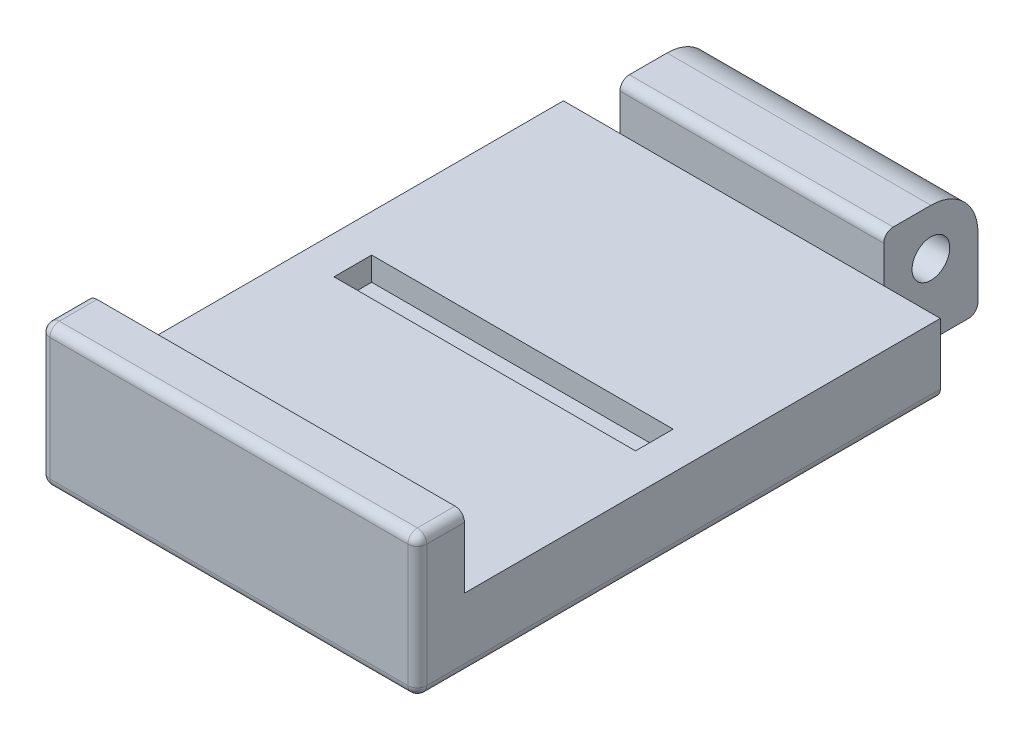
ISO-10303-21;
HEADER;
FILE_DESCRIPTION(('STEP AP214'),'2;1');
FILE_NAME('part.step','',(''),(''),'','','');
FILE_SCHEMA(('AUTOMOTIVE_DESIGN { 1 0 10303 214 1 1 1 1 }'));
ENDSEC;
DATA;
#1=APPLICATION_CONTEXT('core data for automotive mechanical design processes');
#2=APPLICATION_PROTOCOL_DEFINITION('international standard','automotive_design',2000,#1);
#3=PRODUCT_CONTEXT('',#1,'mechanical');
#4=PRODUCT('Part','Part','',(#3));
#5=PRODUCT_RELATED_PRODUCT_CATEGORY('part','',(#4));
#6=PRODUCT_DEFINITION_FORMATION('','',#4);
#7=PRODUCT_DEFINITION_CONTEXT('part definition',#1,'design');
#8=PRODUCT_DEFINITION('design','',#6,#7);
#9=PRODUCT_DEFINITION_SHAPE('','',#8);
#10=(LENGTH_UNIT() NAMED_UNIT(*) SI_UNIT(.MILLI.,.METRE.));
#11=(NAMED_UNIT(*) PLANE_ANGLE_UNIT() SI_UNIT($,.RADIAN.));
#12=(NAMED_UNIT(*) SI_UNIT($,.STERADIAN.) SOLID_ANGLE_UNIT());
#13=UNCERTAINTY_MEASURE_WITH_UNIT(LENGTH_MEASURE(1.E-05),#10,'distance_accuracy_value','');
#14=(GEOMETRIC_REPRESENTATION_CONTEXT(3) GLOBAL_UNCERTAINTY_ASSIGNED_CONTEXT((#13)) GLOBAL_UNIT_ASSIGNED_CONTEXT((#10,
#11,#12)) REPRESENTATION_CONTEXT('',''));
#15=CARTESIAN_POINT('',(0.,0.,0.));
#16=DIRECTION('',(0.,0.,1.));
#17=DIRECTION('',(1.,0.,0.));
#18=AXIS2_PLACEMENT_3D('',#15,#16,#17);
#19=CARTESIAN_POINT('',(0.,0.,0.));
#20=DIRECTION('',(0.,0.,-1.));
#21=DIRECTION('',(-1.,0.,0.));
#22=AXIS2_PLACEMENT_3D('',#19,#20,#21);
#23=PLANE('',#22);
#24=DIRECTION('',(0.,-1.,0.));
#25=VECTOR('',#24,1.);
#26=CARTESIAN_POINT('',(-14.,-7.5,0.));
#27=LINE('',#26,#25);
#28=CARTESIAN_POINT('',(-14.,-0.100000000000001,0.));
#29=VERTEX_POINT('',#28);
#30=CARTESIAN_POINT('',(-14.,-6.5,0.));
#31=VERTEX_POINT('',#30);
#32=EDGE_CURVE('E241',#29,#31,#27,.T.);
#33=ORIENTED_EDGE('',*,*,#32,.F.);
#34=DIRECTION('',(-1.,0.,0.));
#35=VECTOR('',#34,1.);
#36=CARTESIAN_POINT('',(0.,-0.100000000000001,0.));
#37=LINE('',#36,#35);
#38=CARTESIAN_POINT('',(14.,-0.100000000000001,0.));
#39=VERTEX_POINT('',#38);
#40=EDGE_CURVE('E12',#29,#39,#37,.F.);
#41=ORIENTED_EDGE('',*,*,#40,.T.);
#42=DIRECTION('',(0.,-1.,0.));
#43=VECTOR('',#42,1.);
#44=CARTESIAN_POINT('',(14.,0.,0.));
#45=LINE('',#44,#43);
#46=CARTESIAN_POINT('',(14.,-6.5,0.));
#47=VERTEX_POINT('',#46);
#48=EDGE_CURVE('E271',#39,#47,#45,.T.);
#49=ORIENTED_EDGE('',*,*,#48,.T.);
#50=DIRECTION('',(1.,0.,0.));
#51=VECTOR('',#50,1.);
#52=CARTESIAN_POINT('',(-20.,-6.5,0.));
#53=LINE('',#52,#51);
#54=EDGE_CURVE('E339',#47,#31,#53,.F.);
#55=ORIENTED_EDGE('',*,*,#54,.T.);
#56=EDGE_LOOP('',(#33,#41,#49,#55));
#57=FACE_BOUND('',#56,.T.);
#58=ADVANCED_FACE('F36',(#57),#23,.T.);
#59=CARTESIAN_POINT('',(-20.,5.,10.));
#60=DIRECTION('',(0.,0.,-1.));
#61=DIRECTION('',(-1.,0.,0.));
#62=AXIS2_PLACEMENT_3D('',#59,#60,#61);
#63=PLANE('',#62);
#64=DIRECTION('',(0.,1.,0.));
#65=VECTOR('',#64,1.);
#66=CARTESIAN_POINT('',(14.,-7.5,10.));
#67=LINE('',#66,#65);
#68=CARTESIAN_POINT('',(14.,0.,10.));
#69=VERTEX_POINT('',#68);
#70=CARTESIAN_POINT('',(14.,3.9,10.));
#71=VERTEX_POINT('',#70);
#72=EDGE_CURVE('E262',#69,#71,#67,.T.);
#73=ORIENTED_EDGE('',*,*,#72,.T.);
#74=DIRECTION('',(1.,0.,0.));
#75=VECTOR('',#74,1.);
#76=CARTESIAN_POINT('',(-14.,3.9,10.));
#77=LINE('',#76,#75);
#78=CARTESIAN_POINT('',(-14.,3.9,10.));
#79=VERTEX_POINT('',#78);
#80=EDGE_CURVE('E393',#71,#79,#77,.F.);
#81=ORIENTED_EDGE('',*,*,#80,.T.);
#82=DIRECTION('',(0.,-1.,0.));
#83=VECTOR('',#82,1.);
#84=CARTESIAN_POINT('',(-14.,-7.5,10.));
#85=LINE('',#84,#83);
#86=CARTESIAN_POINT('',(-14.,0.,10.));
#87=VERTEX_POINT('',#86);
#88=EDGE_CURVE('E245',#79,#87,#85,.T.);
#89=ORIENTED_EDGE('',*,*,#88,.T.);
#90=DIRECTION('',(1.,0.,0.));
#91=VECTOR('',#90,1.);
#92=CARTESIAN_POINT('',(-20.,0.,10.));
#93=LINE('',#92,#91);
#94=EDGE_CURVE('E291',#87,#69,#93,.T.);
#95=ORIENTED_EDGE('',*,*,#94,.T.);
#96=EDGE_LOOP('',(#73,#81,#89,#95));
#97=FACE_BOUND('',#96,.T.);
#98=ADVANCED_FACE('F414',(#97),#63,.F.);
#99=CARTESIAN_POINT('',(14.,-7.5,-0.999999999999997));
#100=DIRECTION('',(1.,0.,0.));
#101=DIRECTION('',(0.,0.,-1.));
#102=AXIS2_PLACEMENT_3D('',#99,#100,#101);
#103=PLANE('',#102);
#104=CARTESIAN_POINT('',(14.,0.,5.));
#105=DIRECTION('',(1.,0.,0.));
#106=DIRECTION('',(0.,0.,-1.));
#107=AXIS2_PLACEMENT_3D('',#104,#105,#106);
#108=CIRCLE('',#107,2.);
#109=CARTESIAN_POINT('',(14.,0.,3.));
#110=VERTEX_POINT('',#109);
#111=EDGE_CURVE('E238',#110,#110,#108,.T.);
#112=ORIENTED_EDGE('',*,*,#111,.F.);
#113=EDGE_LOOP('',(#112));
#114=FACE_BOUND('',#113,.T.);
#115=DIRECTION('',(0.,0.,1.));
#116=VECTOR('',#115,1.);
#117=CARTESIAN_POINT('',(14.,4.9,-0.999999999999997));
#118=LINE('',#117,#116);
#119=CARTESIAN_POINT('',(14.,4.9,5.));
#120=VERTEX_POINT('',#119);
#121=CARTESIAN_POINT('',(14.,4.9,9.));
#122=VERTEX_POINT('',#121);
#123=EDGE_CURVE('E231',#120,#122,#118,.T.);
#124=ORIENTED_EDGE('',*,*,#123,.T.);
#125=CARTESIAN_POINT('',(14.,3.9,9.));
#126=DIRECTION('',(1.,0.,0.));
#127=DIRECTION('',(0.,0.,-1.));
#128=AXIS2_PLACEMENT_3D('',#125,#126,#127);
#129=CIRCLE('',#128,1.);
#130=EDGE_CURVE('E391',#122,#71,#129,.T.);
#131=ORIENTED_EDGE('',*,*,#130,.T.);
#132=ORIENTED_EDGE('',*,*,#72,.F.);
#133=CARTESIAN_POINT('',(14.,-7.5,10.));
#134=VERTEX_POINT('',#133);
#135=EDGE_CURVE('E263',#134,#69,#67,.T.);
#136=ORIENTED_EDGE('',*,*,#135,.F.);
#137=DIRECTION('',(0.,0.,1.));
#138=VECTOR('',#137,1.);
#139=CARTESIAN_POINT('',(14.,-7.5,-0.999999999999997));
#140=LINE('',#139,#138);
#141=CARTESIAN_POINT('',(14.,-7.5,1.));
#142=VERTEX_POINT('',#141);
#143=EDGE_CURVE('E266',#142,#134,#140,.T.);
#144=ORIENTED_EDGE('',*,*,#143,.F.);
#145=CARTESIAN_POINT('',(14.,-6.5,1.));
#146=DIRECTION('',(1.,0.,0.));
#147=DIRECTION('',(0.,0.,-1.));
#148=AXIS2_PLACEMENT_3D('',#145,#146,#147);
#149=CIRCLE('',#148,1.);
#150=EDGE_CURVE('E273',#47,#142,#149,.F.);
#151=ORIENTED_EDGE('',*,*,#150,.F.);
#152=ORIENTED_EDGE('',*,*,#48,.F.);
#153=CARTESIAN_POINT('',(14.,-0.100000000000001,5.));
#154=DIRECTION('',(1.,0.,0.));
#155=DIRECTION('',(0.,0.,-1.));
#156=AXIS2_PLACEMENT_3D('',#153,#154,#155);
#157=CIRCLE('',#156,5.);
#158=EDGE_CURVE('E389',#39,#120,#157,.T.);
#159=ORIENTED_EDGE('',*,*,#158,.T.);
#160=EDGE_LOOP('',(#124,#131,#132,#136,#144,#151,#152,#159));
#161=FACE_BOUND('',#160,.T.);
#162=ADVANCED_FACE('F410',(#114,#161),#103,.T.);
#163=CARTESIAN_POINT('',(-14.,-7.5,10.));
#164=DIRECTION('',(1.,0.,0.));
#165=DIRECTION('',(0.,1.,0.));
#166=AXIS2_PLACEMENT_3D('',#163,#164,#165);
#167=PLANE('',#166);
#168=CARTESIAN_POINT('',(-14.,0.,5.));
#169=DIRECTION('',(1.,0.,0.));
#170=DIRECTION('',(0.,1.,0.));
#171=AXIS2_PLACEMENT_3D('',#168,#169,#170);
#172=CIRCLE('',#171,2.);
#173=CARTESIAN_POINT('',(-14.,2.,5.));
#174=VERTEX_POINT('',#173);
#175=EDGE_CURVE('E237',#174,#174,#172,.T.);
#176=ORIENTED_EDGE('',*,*,#175,.T.);
#177=EDGE_LOOP('',(#176));
#178=FACE_BOUND('',#177,.T.);
#179=ORIENTED_EDGE('',*,*,#88,.F.);
#180=CARTESIAN_POINT('',(-14.,3.9,9.));
#181=DIRECTION('',(1.,0.,0.));
#182=DIRECTION('',(0.,1.,0.));
#183=AXIS2_PLACEMENT_3D('',#180,#181,#182);
#184=CIRCLE('',#183,1.);
#185=CARTESIAN_POINT('',(-14.,4.9,9.));
#186=VERTEX_POINT('',#185);
#187=EDGE_CURVE('E44',#79,#186,#184,.F.);
#188=ORIENTED_EDGE('',*,*,#187,.T.);
#189=DIRECTION('',(0.,0.,1.));
#190=VECTOR('',#189,1.);
#191=CARTESIAN_POINT('',(-14.,4.9,10.));
#192=LINE('',#191,#190);
#193=CARTESIAN_POINT('',(-14.,4.9,5.));
#194=VERTEX_POINT('',#193);
#195=EDGE_CURVE('E378',#194,#186,#192,.T.);
#196=ORIENTED_EDGE('',*,*,#195,.F.);
#197=CARTESIAN_POINT('',(-14.,-0.100000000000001,5.));
#198=DIRECTION('',(1.,0.,0.));
#199=DIRECTION('',(0.,1.,0.));
#200=AXIS2_PLACEMENT_3D('',#197,#198,#199);
#201=CIRCLE('',#200,5.);
#202=EDGE_CURVE('E59',#194,#29,#201,.F.);
#203=ORIENTED_EDGE('',*,*,#202,.T.);
#204=ORIENTED_EDGE('',*,*,#32,.T.);
#205=CARTESIAN_POINT('',(-14.,-6.5,1.));
#206=DIRECTION('',(1.,0.,0.));
#207=DIRECTION('',(0.,1.,0.));
#208=AXIS2_PLACEMENT_3D('',#205,#206,#207);
#209=CIRCLE('',#208,1.);
#210=CARTESIAN_POINT('',(-14.,-7.5,1.));
#211=VERTEX_POINT('',#210);
#212=EDGE_CURVE('E256',#31,#211,#209,.F.);
#213=ORIENTED_EDGE('',*,*,#212,.T.);
#214=DIRECTION('',(0.,0.,-1.));
#215=VECTOR('',#214,1.);
#216=CARTESIAN_POINT('',(-14.,-7.5,10.));
#217=LINE('',#216,#215);
#218=CARTESIAN_POINT('',(-14.,-7.5,10.));
#219=VERTEX_POINT('',#218);
#220=EDGE_CURVE('E249',#219,#211,#217,.T.);
#221=ORIENTED_EDGE('',*,*,#220,.F.);
#222=EDGE_CURVE('E244',#87,#219,#85,.T.);
#223=ORIENTED_EDGE('',*,*,#222,.F.);
#224=EDGE_LOOP('',(#179,#188,#196,#203,#204,#213,#221,#223));
#225=FACE_BOUND('',#224,.T.);
#226=ADVANCED_FACE('F397',(#178,#225),#167,.F.);
#227=CARTESIAN_POINT('',(-20.,-7.5,65.5));
#228=DIRECTION('',(1.,0.,0.));
#229=DIRECTION('',(0.,0.,-1.));
#230=AXIS2_PLACEMENT_3D('',#227,#228,#229);
#231=PLANE('',#230);
#232=DIRECTION('',(0.,1.,0.));
#233=VECTOR('',#232,1.);
#234=CARTESIAN_POINT('',(-20.,-7.5,10.));
#235=LINE('',#234,#233);
#236=CARTESIAN_POINT('',(-20.,-6.5,10.));
#237=VERTEX_POINT('',#236);
#238=CARTESIAN_POINT('',(-20.,0.,10.));
#239=VERTEX_POINT('',#238);
#240=EDGE_CURVE('E242',#237,#239,#235,.T.);
#241=ORIENTED_EDGE('',*,*,#240,.F.);
#242=DIRECTION('',(0.,0.,-1.));
#243=VECTOR('',#242,1.);
#244=CARTESIAN_POINT('',(-20.,-6.5,65.5));
#245=LINE('',#244,#243);
#246=CARTESIAN_POINT('',(-20.,-6.5,64.5));
#247=VERTEX_POINT('',#246);
#248=EDGE_CURVE('E332',#237,#247,#245,.F.);
#249=ORIENTED_EDGE('',*,*,#248,.T.);
#250=DIRECTION('',(0.,-1.,0.));
#251=VECTOR('',#250,1.);
#252=CARTESIAN_POINT('',(-20.,-7.5,64.5));
#253=LINE('',#252,#251);
#254=CARTESIAN_POINT('',(-20.,6.5,64.5));
#255=VERTEX_POINT('',#254);
#256=EDGE_CURVE('E334',#247,#255,#253,.F.);
#257=ORIENTED_EDGE('',*,*,#256,.T.);
#258=DIRECTION('',(0.,0.,-1.));
#259=VECTOR('',#258,1.);
#260=CARTESIAN_POINT('',(-20.,6.5,65.5));
#261=LINE('',#260,#259);
#262=CARTESIAN_POINT('',(-20.,6.5,60.5));
#263=VERTEX_POINT('',#262);
#264=EDGE_CURVE('E336',#255,#263,#261,.T.);
#265=ORIENTED_EDGE('',*,*,#264,.T.);
#266=DIRECTION('',(0.,-1.,0.));
#267=VECTOR('',#266,1.);
#268=CARTESIAN_POINT('',(-20.,7.49999999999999,60.5));
#269=LINE('',#268,#267);
#270=CARTESIAN_POINT('',(-20.,0.,60.5));
#271=VERTEX_POINT('',#270);
#272=EDGE_CURVE('E277',#263,#271,#269,.T.);
#273=ORIENTED_EDGE('',*,*,#272,.T.);
#274=DIRECTION('',(0.,0.,-1.));
#275=VECTOR('',#274,1.);
#276=CARTESIAN_POINT('',(-20.,0.,60.5));
#277=LINE('',#276,#275);
#278=EDGE_CURVE('E279',#271,#239,#277,.T.);
#279=ORIENTED_EDGE('',*,*,#278,.T.);
#280=EDGE_LOOP('',(#241,#249,#257,#265,#273,#279));
#281=FACE_BOUND('',#280,.T.);
#282=ADVANCED_FACE('F449',(#281),#231,.F.);
#283=CARTESIAN_POINT('',(-19.,-6.5,65.5));
#284=DIRECTION('',(0.,0.,-1.));
#285=DIRECTION('',(-1.,0.,0.));
#286=AXIS2_PLACEMENT_3D('',#283,#284,#285);
#287=CYLINDRICAL_SURFACE('',#286,1.);
#288=ORIENTED_EDGE('',*,*,#248,.F.);
#289=CARTESIAN_POINT('',(-19.,-6.5,10.));
#290=DIRECTION('',(0.,0.,-1.));
#291=DIRECTION('',(-1.,0.,0.));
#292=AXIS2_PLACEMENT_3D('',#289,#290,#291);
#293=CIRCLE('',#292,1.);
#294=CARTESIAN_POINT('',(-19.,-7.5,10.));
#295=VERTEX_POINT('',#294);
#296=EDGE_CURVE('E253',#237,#295,#293,.F.);
#297=ORIENTED_EDGE('',*,*,#296,.T.);
#298=DIRECTION('',(0.,0.,-1.));
#299=VECTOR('',#298,1.);
#300=CARTESIAN_POINT('',(-19.,-7.5,65.5));
#301=LINE('',#300,#299);
#302=CARTESIAN_POINT('',(-19.,-7.5,64.5));
#303=VERTEX_POINT('',#302);
#304=EDGE_CURVE('E316',#303,#295,#301,.T.);
#305=ORIENTED_EDGE('',*,*,#304,.F.);
#306=CARTESIAN_POINT('',(-19.,-6.5,64.5));
#307=DIRECTION('',(0.,0.,1.));
#308=DIRECTION('',(1.,0.,0.));
#309=AXIS2_PLACEMENT_3D('',#306,#307,#308);
#310=CIRCLE('',#309,1.);
#311=EDGE_CURVE('E302',#247,#303,#310,.T.);
#312=ORIENTED_EDGE('',*,*,#311,.F.);
#313=EDGE_LOOP('',(#288,#297,#305,#312));
#314=FACE_BOUND('',#313,.T.);
#315=ADVANCED_FACE('F445',(#314),#287,.T.);
#316=CARTESIAN_POINT('',(-20.,-7.5,65.5));
#317=DIRECTION('',(0.,1.,0.));
#318=DIRECTION('',(0.,0.,1.));
#319=AXIS2_PLACEMENT_3D('',#316,#317,#318);
#320=PLANE('',#319);
#321=DIRECTION('',(-1.,0.,0.));
#322=VECTOR('',#321,1.);
#323=CARTESIAN_POINT('',(-20.,-7.5,10.));
#324=LINE('',#323,#322);
#325=EDGE_CURVE('E247',#219,#295,#324,.T.);
#326=ORIENTED_EDGE('',*,*,#325,.F.);
#327=ORIENTED_EDGE('',*,*,#220,.T.);
#328=DIRECTION('',(1.,0.,0.));
#329=VECTOR('',#328,1.);
#330=CARTESIAN_POINT('',(20.,-7.5,1.));
#331=LINE('',#330,#329);
#332=EDGE_CURVE('E314',#211,#142,#331,.T.);
#333=ORIENTED_EDGE('',*,*,#332,.T.);
#334=ORIENTED_EDGE('',*,*,#143,.T.);
#335=DIRECTION('',(-1.,0.,0.));
#336=VECTOR('',#335,1.);
#337=CARTESIAN_POINT('',(20.,-7.5,10.));
#338=LINE('',#337,#336);
#339=CARTESIAN_POINT('',(19.,-7.5,10.));
#340=VERTEX_POINT('',#339);
#341=EDGE_CURVE('E260',#340,#134,#338,.T.);
#342=ORIENTED_EDGE('',*,*,#341,.F.);
#343=DIRECTION('',(0.,0.,-1.));
#344=VECTOR('',#343,1.);
#345=CARTESIAN_POINT('',(19.,-7.5,65.5));
#346=LINE('',#345,#344);
#347=CARTESIAN_POINT('',(19.,-7.5,64.5));
#348=VERTEX_POINT('',#347);
#349=EDGE_CURVE('E321',#340,#348,#346,.F.);
#350=ORIENTED_EDGE('',*,*,#349,.T.);
#351=DIRECTION('',(1.,0.,0.));
#352=VECTOR('',#351,1.);
#353=CARTESIAN_POINT('',(-20.,-7.5,64.5));
#354=LINE('',#353,#352);
#355=EDGE_CURVE('E319',#348,#303,#354,.F.);
#356=ORIENTED_EDGE('',*,*,#355,.T.);
#357=ORIENTED_EDGE('',*,*,#304,.T.);
#358=EDGE_LOOP('',(#326,#327,#333,#334,#342,#350,#356,#357));
#359=FACE_BOUND('',#358,.T.);
#360=ADVANCED_FACE('F426',(#359),#320,.F.);
#361=CARTESIAN_POINT('',(-20.,-6.5,1.));
#362=DIRECTION('',(-1.,0.,0.));
#363=DIRECTION('',(0.,0.,1.));
#364=AXIS2_PLACEMENT_3D('',#361,#362,#363);
#365=CYLINDRICAL_SURFACE('',#364,1.);
#366=ORIENTED_EDGE('',*,*,#212,.F.);
#367=ORIENTED_EDGE('',*,*,#54,.F.);
#368=ORIENTED_EDGE('',*,*,#150,.T.);
#369=ORIENTED_EDGE('',*,*,#332,.F.);
#370=EDGE_LOOP('',(#366,#367,#368,#369));
#371=FACE_BOUND('',#370,.T.);
#372=ADVANCED_FACE('F432',(#371),#365,.T.);
#373=CARTESIAN_POINT('',(20.,-7.5,65.5));
#374=DIRECTION('',(-1.,0.,0.));
#375=DIRECTION('',(0.,0.,1.));
#376=AXIS2_PLACEMENT_3D('',#373,#374,#375);
#377=PLANE('',#376);
#378=DIRECTION('',(0.,0.,-1.));
#379=VECTOR('',#378,1.);
#380=CARTESIAN_POINT('',(20.,-6.5,65.5));
#381=LINE('',#380,#379);
#382=CARTESIAN_POINT('',(20.,-6.5,64.5));
#383=VERTEX_POINT('',#382);
#384=CARTESIAN_POINT('',(20.,-6.5,10.));
#385=VERTEX_POINT('',#384);
#386=EDGE_CURVE('E307',#383,#385,#381,.T.);
#387=ORIENTED_EDGE('',*,*,#386,.T.);
#388=DIRECTION('',(0.,-1.,0.));
#389=VECTOR('',#388,1.);
#390=CARTESIAN_POINT('',(20.,-7.5,10.));
#391=LINE('',#390,#389);
#392=CARTESIAN_POINT('',(20.,0.,10.));
#393=VERTEX_POINT('',#392);
#394=EDGE_CURVE('E258',#393,#385,#391,.T.);
#395=ORIENTED_EDGE('',*,*,#394,.F.);
#396=DIRECTION('',(0.,0.,-1.));
#397=VECTOR('',#396,1.);
#398=CARTESIAN_POINT('',(20.,0.,55.501553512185));
#399=LINE('',#398,#397);
#400=CARTESIAN_POINT('',(20.,0.,60.5));
#401=VERTEX_POINT('',#400);
#402=EDGE_CURVE('E280',#401,#393,#399,.T.);
#403=ORIENTED_EDGE('',*,*,#402,.F.);
#404=DIRECTION('',(0.,-1.,0.));
#405=VECTOR('',#404,1.);
#406=CARTESIAN_POINT('',(20.,7.49999999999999,60.5));
#407=LINE('',#406,#405);
#408=CARTESIAN_POINT('',(20.,6.5,60.5));
#409=VERTEX_POINT('',#408);
#410=EDGE_CURVE('E276',#409,#401,#407,.T.);
#411=ORIENTED_EDGE('',*,*,#410,.F.);
#412=DIRECTION('',(0.,0.,-1.));
#413=VECTOR('',#412,1.);
#414=CARTESIAN_POINT('',(20.,6.5,65.5));
#415=LINE('',#414,#413);
#416=CARTESIAN_POINT('',(20.,6.5,64.5));
#417=VERTEX_POINT('',#416);
#418=EDGE_CURVE('E310',#409,#417,#415,.F.);
#419=ORIENTED_EDGE('',*,*,#418,.T.);
#420=DIRECTION('',(0.,1.,0.));
#421=VECTOR('',#420,1.);
#422=CARTESIAN_POINT('',(20.,-7.5,64.5));
#423=LINE('',#422,#421);
#424=EDGE_CURVE('E312',#417,#383,#423,.F.);
#425=ORIENTED_EDGE('',*,*,#424,.T.);
#426=EDGE_LOOP('',(#387,#395,#403,#411,#419,#425));
#427=FACE_BOUND('',#426,.T.);
#428=ADVANCED_FACE('F459',(#427),#377,.F.);
#429=CARTESIAN_POINT('',(-20.,7.5,65.5));
#430=DIRECTION('',(0.,-1.,0.));
#431=DIRECTION('',(0.,0.,-1.));
#432=AXIS2_PLACEMENT_3D('',#429,#430,#431);
#433=PLANE('',#432);
#434=DIRECTION('',(0.,0.,-1.));
#435=VECTOR('',#434,1.);
#436=CARTESIAN_POINT('',(19.,7.5,65.5));
#437=LINE('',#436,#435);
#438=CARTESIAN_POINT('',(19.,7.5,64.5));
#439=VERTEX_POINT('',#438);
#440=CARTESIAN_POINT('',(19.,7.5,60.5));
#441=VERTEX_POINT('',#440);
#442=EDGE_CURVE('E304',#439,#441,#437,.T.);
#443=ORIENTED_EDGE('',*,*,#442,.T.);
#444=DIRECTION('',(1.,0.,0.));
#445=VECTOR('',#444,1.);
#446=CARTESIAN_POINT('',(-20.,7.49999999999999,60.5));
#447=LINE('',#446,#445);
#448=CARTESIAN_POINT('',(-19.,7.49999999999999,60.5));
#449=VERTEX_POINT('',#448);
#450=EDGE_CURVE('E283',#449,#441,#447,.T.);
#451=ORIENTED_EDGE('',*,*,#450,.F.);
#452=DIRECTION('',(0.,0.,-1.));
#453=VECTOR('',#452,1.);
#454=CARTESIAN_POINT('',(-19.,7.5,65.5));
#455=LINE('',#454,#453);
#456=CARTESIAN_POINT('',(-19.,7.5,64.5));
#457=VERTEX_POINT('',#456);
#458=EDGE_CURVE('E299',#449,#457,#455,.F.);
#459=ORIENTED_EDGE('',*,*,#458,.T.);
#460=DIRECTION('',(-1.,0.,0.));
#461=VECTOR('',#460,1.);
#462=CARTESIAN_POINT('',(-20.,7.5,64.5));
#463=LINE('',#462,#461);
#464=EDGE_CURVE('E301',#457,#439,#463,.F.);
#465=ORIENTED_EDGE('',*,*,#464,.T.);
#466=EDGE_LOOP('',(#443,#451,#459,#465));
#467=FACE_BOUND('',#466,.T.);
#468=ADVANCED_FACE('F491',(#467),#433,.F.);
#469=CARTESIAN_POINT('',(0.,0.,65.5));
#470=DIRECTION('',(0.,0.,-1.));
#471=DIRECTION('',(-1.,0.,0.));
#472=AXIS2_PLACEMENT_3D('',#469,#470,#471);
#473=PLANE('',#472);
#474=DIRECTION('',(1.,0.,0.));
#475=VECTOR('',#474,1.);
#476=CARTESIAN_POINT('',(0.,-6.5,65.5));
#477=LINE('',#476,#475);
#478=CARTESIAN_POINT('',(-19.,-6.5,65.5));
#479=VERTEX_POINT('',#478);
#480=CARTESIAN_POINT('',(19.,-6.5,65.5));
#481=VERTEX_POINT('',#480);
#482=EDGE_CURVE('E327',#479,#481,#477,.T.);
#483=ORIENTED_EDGE('',*,*,#482,.T.);
#484=DIRECTION('',(0.,1.,0.));
#485=VECTOR('',#484,1.);
#486=CARTESIAN_POINT('',(19.,0.,65.5));
#487=LINE('',#486,#485);
#488=CARTESIAN_POINT('',(19.,6.5,65.5));
#489=VERTEX_POINT('',#488);
#490=EDGE_CURVE('E330',#481,#489,#487,.T.);
#491=ORIENTED_EDGE('',*,*,#490,.T.);
#492=DIRECTION('',(-1.,0.,0.));
#493=VECTOR('',#492,1.);
#494=CARTESIAN_POINT('',(0.,6.5,65.5));
#495=LINE('',#494,#493);
#496=CARTESIAN_POINT('',(-19.,6.5,65.5));
#497=VERTEX_POINT('',#496);
#498=EDGE_CURVE('E325',#489,#497,#495,.T.);
#499=ORIENTED_EDGE('',*,*,#498,.T.);
#500=DIRECTION('',(0.,-1.,0.));
#501=VECTOR('',#500,1.);
#502=CARTESIAN_POINT('',(-19.,0.,65.5));
#503=LINE('',#502,#501);
#504=EDGE_CURVE('E323',#497,#479,#503,.T.);
#505=ORIENTED_EDGE('',*,*,#504,.T.);
#506=EDGE_LOOP('',(#483,#491,#499,#505));
#507=FACE_BOUND('',#506,.T.);
#508=ADVANCED_FACE('F475',(#507),#473,.F.);
#509=CARTESIAN_POINT('',(-19.,-6.5,64.5));
#510=DIRECTION('',(0.,0.,1.));
#511=DIRECTION('',(1.,0.,0.));
#512=AXIS2_PLACEMENT_3D('',#509,#510,#511);
#513=SPHERICAL_SURFACE('',#512,1.);
#514=CARTESIAN_POINT('',(-19.,-6.5,64.5));
#515=DIRECTION('',(0.,-1.,0.));
#516=DIRECTION('',(0.,0.,-1.));
#517=AXIS2_PLACEMENT_3D('',#514,#515,#516);
#518=CIRCLE('',#517,1.);
#519=EDGE_CURVE('E369',#247,#479,#518,.F.);
#520=ORIENTED_EDGE('',*,*,#519,.F.);
#521=ORIENTED_EDGE('',*,*,#311,.T.);
#522=CARTESIAN_POINT('',(-19.,-6.5,64.5));
#523=DIRECTION('',(-1.,0.,0.));
#524=DIRECTION('',(0.,0.,1.));
#525=AXIS2_PLACEMENT_3D('',#522,#523,#524);
#526=CIRCLE('',#525,1.);
#527=EDGE_CURVE('E372',#479,#303,#526,.F.);
#528=ORIENTED_EDGE('',*,*,#527,.F.);
#529=EDGE_LOOP('',(#520,#521,#528));
#530=FACE_BOUND('',#529,.T.);
#531=ADVANCED_FACE('F483',(#530),#513,.T.);
#532=CARTESIAN_POINT('',(0.,-6.5,64.5));
#533=DIRECTION('',(1.,0.,0.));
#534=DIRECTION('',(0.,0.,-1.));
#535=AXIS2_PLACEMENT_3D('',#532,#533,#534);
#536=CYLINDRICAL_SURFACE('',#535,1.);
#537=ORIENTED_EDGE('',*,*,#527,.T.);
#538=ORIENTED_EDGE('',*,*,#355,.F.);
#539=CARTESIAN_POINT('',(19.,-6.5,64.5));
#540=DIRECTION('',(1.,0.,0.));
#541=DIRECTION('',(0.,0.,-1.));
#542=AXIS2_PLACEMENT_3D('',#539,#540,#541);
#543=CIRCLE('',#542,1.);
#544=EDGE_CURVE('E363',#481,#348,#543,.T.);
#545=ORIENTED_EDGE('',*,*,#544,.F.);
#546=ORIENTED_EDGE('',*,*,#482,.F.);
#547=EDGE_LOOP('',(#537,#538,#545,#546));
#548=FACE_BOUND('',#547,.T.);
#549=ADVANCED_FACE('F473',(#548),#536,.T.);
#550=CARTESIAN_POINT('',(-19.,0.,64.5));
#551=DIRECTION('',(0.,-1.,0.));
#552=DIRECTION('',(0.,0.,-1.));
#553=AXIS2_PLACEMENT_3D('',#550,#551,#552);
#554=CYLINDRICAL_SURFACE('',#553,1.);
#555=ORIENTED_EDGE('',*,*,#519,.T.);
#556=ORIENTED_EDGE('',*,*,#504,.F.);
#557=CARTESIAN_POINT('',(-19.,6.5,64.5));
#558=DIRECTION('',(0.,1.,0.));
#559=DIRECTION('',(0.,0.,1.));
#560=AXIS2_PLACEMENT_3D('',#557,#558,#559);
#561=CIRCLE('',#560,1.);
#562=EDGE_CURVE('E360',#255,#497,#561,.T.);
#563=ORIENTED_EDGE('',*,*,#562,.F.);
#564=ORIENTED_EDGE('',*,*,#256,.F.);
#565=EDGE_LOOP('',(#555,#556,#563,#564));
#566=FACE_BOUND('',#565,.T.);
#567=ADVANCED_FACE('F481',(#566),#554,.T.);
#568=CARTESIAN_POINT('',(-19.,6.5,65.5));
#569=DIRECTION('',(0.,0.,-1.));
#570=DIRECTION('',(-1.,0.,0.));
#571=AXIS2_PLACEMENT_3D('',#568,#569,#570);
#572=CYLINDRICAL_SURFACE('',#571,1.);
#573=CARTESIAN_POINT('',(-19.,6.5,60.5));
#574=DIRECTION('',(0.,0.,1.));
#575=DIRECTION('',(1.,0.,0.));
#576=AXIS2_PLACEMENT_3D('',#573,#574,#575);
#577=CIRCLE('',#576,1.);
#578=EDGE_CURVE('E290',#263,#449,#577,.F.);
#579=ORIENTED_EDGE('',*,*,#578,.F.);
#580=ORIENTED_EDGE('',*,*,#264,.F.);
#581=CARTESIAN_POINT('',(-19.,6.5,64.5));
#582=DIRECTION('',(0.,0.,1.));
#583=DIRECTION('',(1.,0.,0.));
#584=AXIS2_PLACEMENT_3D('',#581,#582,#583);
#585=CIRCLE('',#584,1.);
#586=EDGE_CURVE('E357',#457,#255,#585,.T.);
#587=ORIENTED_EDGE('',*,*,#586,.F.);
#588=ORIENTED_EDGE('',*,*,#458,.F.);
#589=EDGE_LOOP('',(#579,#580,#587,#588));
#590=FACE_BOUND('',#589,.T.);
#591=ADVANCED_FACE('F535',(#590),#572,.T.);
#592=CARTESIAN_POINT('',(19.,-6.5,65.5));
#593=DIRECTION('',(0.,0.,-1.));
#594=DIRECTION('',(-1.,0.,0.));
#595=AXIS2_PLACEMENT_3D('',#592,#593,#594);
#596=CYLINDRICAL_SURFACE('',#595,1.);
#597=CARTESIAN_POINT('',(19.,-6.5,10.));
#598=DIRECTION('',(0.,0.,1.));
#599=DIRECTION('',(1.,0.,0.));
#600=AXIS2_PLACEMENT_3D('',#597,#598,#599);
#601=CIRCLE('',#600,1.);
#602=EDGE_CURVE('E269',#385,#340,#601,.F.);
#603=ORIENTED_EDGE('',*,*,#602,.F.);
#604=ORIENTED_EDGE('',*,*,#386,.F.);
#605=CARTESIAN_POINT('',(19.,-6.5,64.5));
#606=DIRECTION('',(0.,0.,1.));
#607=DIRECTION('',(1.,0.,0.));
#608=AXIS2_PLACEMENT_3D('',#605,#606,#607);
#609=CIRCLE('',#608,1.);
#610=EDGE_CURVE('E366',#348,#383,#609,.T.);
#611=ORIENTED_EDGE('',*,*,#610,.F.);
#612=ORIENTED_EDGE('',*,*,#349,.F.);
#613=EDGE_LOOP('',(#603,#604,#611,#612));
#614=FACE_BOUND('',#613,.T.);
#615=ADVANCED_FACE('F464',(#614),#596,.T.);
#616=CARTESIAN_POINT('',(19.,-6.5,64.5));
#617=DIRECTION('',(0.,0.,1.));
#618=DIRECTION('',(1.,0.,0.));
#619=AXIS2_PLACEMENT_3D('',#616,#617,#618);
#620=SPHERICAL_SURFACE('',#619,1.);
#621=ORIENTED_EDGE('',*,*,#544,.T.);
#622=ORIENTED_EDGE('',*,*,#610,.T.);
#623=CARTESIAN_POINT('',(19.,-6.5,64.5));
#624=DIRECTION('',(0.,-1.,0.));
#625=DIRECTION('',(0.,0.,-1.));
#626=AXIS2_PLACEMENT_3D('',#623,#624,#625);
#627=CIRCLE('',#626,1.);
#628=EDGE_CURVE('E354',#481,#383,#627,.F.);
#629=ORIENTED_EDGE('',*,*,#628,.F.);
#630=EDGE_LOOP('',(#621,#622,#629));
#631=FACE_BOUND('',#630,.T.);
#632=ADVANCED_FACE('F470',(#631),#620,.T.);
#633=CARTESIAN_POINT('',(-19.,6.5,64.5));
#634=DIRECTION('',(0.,0.,1.));
#635=DIRECTION('',(1.,0.,0.));
#636=AXIS2_PLACEMENT_3D('',#633,#634,#635);
#637=SPHERICAL_SURFACE('',#636,1.);
#638=ORIENTED_EDGE('',*,*,#586,.T.);
#639=ORIENTED_EDGE('',*,*,#562,.T.);
#640=CARTESIAN_POINT('',(-19.,6.5,64.5));
#641=DIRECTION('',(-1.,0.,0.));
#642=DIRECTION('',(0.,0.,1.));
#643=AXIS2_PLACEMENT_3D('',#640,#641,#642);
#644=CIRCLE('',#643,1.);
#645=EDGE_CURVE('E351',#457,#497,#644,.F.);
#646=ORIENTED_EDGE('',*,*,#645,.F.);
#647=EDGE_LOOP('',(#638,#639,#646));
#648=FACE_BOUND('',#647,.T.);
#649=ADVANCED_FACE('F526',(#648),#637,.T.);
#650=CARTESIAN_POINT('',(19.,0.,64.5));
#651=DIRECTION('',(0.,1.,0.));
#652=DIRECTION('',(0.,0.,1.));
#653=AXIS2_PLACEMENT_3D('',#650,#651,#652);
#654=CYLINDRICAL_SURFACE('',#653,1.);
#655=ORIENTED_EDGE('',*,*,#628,.T.);
#656=ORIENTED_EDGE('',*,*,#424,.F.);
#657=CARTESIAN_POINT('',(19.,6.5,64.5));
#658=DIRECTION('',(0.,1.,0.));
#659=DIRECTION('',(0.,0.,1.));
#660=AXIS2_PLACEMENT_3D('',#657,#658,#659);
#661=CIRCLE('',#660,1.);
#662=EDGE_CURVE('E348',#489,#417,#661,.T.);
#663=ORIENTED_EDGE('',*,*,#662,.F.);
#664=ORIENTED_EDGE('',*,*,#490,.F.);
#665=EDGE_LOOP('',(#655,#656,#663,#664));
#666=FACE_BOUND('',#665,.T.);
#667=ADVANCED_FACE('F522',(#666),#654,.T.);
#668=CARTESIAN_POINT('',(0.,6.5,64.5));
#669=DIRECTION('',(-1.,0.,0.));
#670=DIRECTION('',(0.,0.,1.));
#671=AXIS2_PLACEMENT_3D('',#668,#669,#670);
#672=CYLINDRICAL_SURFACE('',#671,1.);
#673=ORIENTED_EDGE('',*,*,#645,.T.);
#674=ORIENTED_EDGE('',*,*,#498,.F.);
#675=CARTESIAN_POINT('',(19.,6.5,64.5));
#676=DIRECTION('',(1.,0.,0.));
#677=DIRECTION('',(0.,0.,-1.));
#678=AXIS2_PLACEMENT_3D('',#675,#676,#677);
#679=CIRCLE('',#678,1.);
#680=EDGE_CURVE('E345',#439,#489,#679,.T.);
#681=ORIENTED_EDGE('',*,*,#680,.F.);
#682=ORIENTED_EDGE('',*,*,#464,.F.);
#683=EDGE_LOOP('',(#673,#674,#681,#682));
#684=FACE_BOUND('',#683,.T.);
#685=ADVANCED_FACE('F518',(#684),#672,.T.);
#686=CARTESIAN_POINT('',(19.,6.5,64.5));
#687=DIRECTION('',(0.,0.,1.));
#688=DIRECTION('',(1.,0.,0.));
#689=AXIS2_PLACEMENT_3D('',#686,#687,#688);
#690=SPHERICAL_SURFACE('',#689,1.);
#691=ORIENTED_EDGE('',*,*,#680,.T.);
#692=ORIENTED_EDGE('',*,*,#662,.T.);
#693=CARTESIAN_POINT('',(19.,6.5,64.5));
#694=DIRECTION('',(0.,0.,1.));
#695=DIRECTION('',(1.,0.,0.));
#696=AXIS2_PLACEMENT_3D('',#693,#694,#695);
#697=CIRCLE('',#696,1.);
#698=EDGE_CURVE('E298',#439,#417,#697,.F.);
#699=ORIENTED_EDGE('',*,*,#698,.F.);
#700=EDGE_LOOP('',(#691,#692,#699));
#701=FACE_BOUND('',#700,.T.);
#702=ADVANCED_FACE('F514',(#701),#690,.T.);
#703=CARTESIAN_POINT('',(19.,6.5,65.5));
#704=DIRECTION('',(0.,0.,-1.));
#705=DIRECTION('',(-1.,0.,0.));
#706=AXIS2_PLACEMENT_3D('',#703,#704,#705);
#707=CYLINDRICAL_SURFACE('',#706,1.);
#708=CARTESIAN_POINT('',(19.,6.5,60.5));
#709=DIRECTION('',(0.,0.,1.));
#710=DIRECTION('',(1.,0.,0.));
#711=AXIS2_PLACEMENT_3D('',#708,#709,#710);
#712=CIRCLE('',#711,1.);
#713=EDGE_CURVE('E342',#441,#409,#712,.F.);
#714=ORIENTED_EDGE('',*,*,#713,.F.);
#715=ORIENTED_EDGE('',*,*,#442,.F.);
#716=ORIENTED_EDGE('',*,*,#698,.T.);
#717=ORIENTED_EDGE('',*,*,#418,.F.);
#718=EDGE_LOOP('',(#714,#715,#716,#717));
#719=FACE_BOUND('',#718,.T.);
#720=ADVANCED_FACE('F511',(#719),#707,.T.);
#721=CARTESIAN_POINT('',(-20.,0.,55.501553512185));
#722=DIRECTION('',(0.,-1.,0.));
#723=DIRECTION('',(0.,0.,-1.));
#724=AXIS2_PLACEMENT_3D('',#721,#722,#723);
#725=PLANE('',#724);
#726=DIRECTION('',(1.,0.,0.));
#727=VECTOR('',#726,1.);
#728=CARTESIAN_POINT('',(-16.,0.,38.35));
#729=LINE('',#728,#727);
#730=CARTESIAN_POINT('',(-16.,0.,38.35));
#731=VERTEX_POINT('',#730);
#732=CARTESIAN_POINT('',(16.,0.,38.35));
#733=VERTEX_POINT('',#732);
#734=EDGE_CURVE('E225',#731,#733,#729,.T.);
#735=ORIENTED_EDGE('',*,*,#734,.F.);
#736=DIRECTION('',(0.,0.,1.));
#737=VECTOR('',#736,1.);
#738=CARTESIAN_POINT('',(-16.,0.,34.35));
#739=LINE('',#738,#737);
#740=CARTESIAN_POINT('',(-16.,0.,34.35));
#741=VERTEX_POINT('',#740);
#742=EDGE_CURVE('E51',#741,#731,#739,.T.);
#743=ORIENTED_EDGE('',*,*,#742,.F.);
#744=DIRECTION('',(-1.,0.,0.));
#745=VECTOR('',#744,1.);
#746=CARTESIAN_POINT('',(-16.,0.,34.35));
#747=LINE('',#746,#745);
#748=CARTESIAN_POINT('',(16.,0.,34.35));
#749=VERTEX_POINT('',#748);
#750=EDGE_CURVE('E216',#749,#741,#747,.T.);
#751=ORIENTED_EDGE('',*,*,#750,.F.);
#752=DIRECTION('',(0.,0.,-1.));
#753=VECTOR('',#752,1.);
#754=CARTESIAN_POINT('',(16.,0.,34.35));
#755=LINE('',#754,#753);
#756=EDGE_CURVE('E219',#733,#749,#755,.T.);
#757=ORIENTED_EDGE('',*,*,#756,.F.);
#758=EDGE_LOOP('',(#735,#743,#751,#757));
#759=FACE_BOUND('',#758,.T.);
#760=ORIENTED_EDGE('',*,*,#402,.T.);
#761=EDGE_CURVE('E292',#69,#393,#93,.T.);
#762=ORIENTED_EDGE('',*,*,#761,.F.);
#763=ORIENTED_EDGE('',*,*,#94,.F.);
#764=EDGE_CURVE('E287',#239,#87,#93,.T.);
#765=ORIENTED_EDGE('',*,*,#764,.F.);
#766=ORIENTED_EDGE('',*,*,#278,.F.);
#767=DIRECTION('',(1.,0.,0.));
#768=VECTOR('',#767,1.);
#769=CARTESIAN_POINT('',(-20.,0.,60.5));
#770=LINE('',#769,#768);
#771=EDGE_CURVE('E293',#271,#401,#770,.T.);
#772=ORIENTED_EDGE('',*,*,#771,.T.);
#773=EDGE_LOOP('',(#760,#762,#763,#765,#766,#772));
#774=FACE_BOUND('',#773,.T.);
#775=ADVANCED_FACE('F453',(#759,#774),#725,.F.);
#776=CARTESIAN_POINT('',(-20.,7.49999999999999,60.5));
#777=DIRECTION('',(0.,0.,1.));
#778=DIRECTION('',(1.,0.,0.));
#779=AXIS2_PLACEMENT_3D('',#776,#777,#778);
#780=PLANE('',#779);
#781=ORIENTED_EDGE('',*,*,#410,.T.);
#782=ORIENTED_EDGE('',*,*,#771,.F.);
#783=ORIENTED_EDGE('',*,*,#272,.F.);
#784=ORIENTED_EDGE('',*,*,#578,.T.);
#785=ORIENTED_EDGE('',*,*,#450,.T.);
#786=ORIENTED_EDGE('',*,*,#713,.T.);
#787=EDGE_LOOP('',(#781,#782,#783,#784,#785,#786));
#788=FACE_BOUND('',#787,.T.);
#789=ADVANCED_FACE('F586',(#788),#780,.F.);
#790=CARTESIAN_POINT('',(0.,0.,10.));
#791=DIRECTION('',(0.,0.,1.));
#792=DIRECTION('',(1.,0.,0.));
#793=AXIS2_PLACEMENT_3D('',#790,#791,#792);
#794=PLANE('',#793);
#795=ORIENTED_EDGE('',*,*,#602,.T.);
#796=ORIENTED_EDGE('',*,*,#341,.T.);
#797=ORIENTED_EDGE('',*,*,#135,.T.);
#798=ORIENTED_EDGE('',*,*,#761,.T.);
#799=ORIENTED_EDGE('',*,*,#394,.T.);
#800=EDGE_LOOP('',(#795,#796,#797,#798,#799));
#801=FACE_BOUND('',#800,.T.);
#802=ADVANCED_FACE('F419',(#801),#794,.F.);
#803=CARTESIAN_POINT('',(0.,0.,10.));
#804=DIRECTION('',(0.,0.,-1.));
#805=DIRECTION('',(-1.,0.,0.));
#806=AXIS2_PLACEMENT_3D('',#803,#804,#805);
#807=PLANE('',#806);
#808=ORIENTED_EDGE('',*,*,#240,.T.);
#809=ORIENTED_EDGE('',*,*,#764,.T.);
#810=ORIENTED_EDGE('',*,*,#222,.T.);
#811=ORIENTED_EDGE('',*,*,#325,.T.);
#812=ORIENTED_EDGE('',*,*,#296,.F.);
#813=EDGE_LOOP('',(#808,#809,#810,#811,#812));
#814=FACE_BOUND('',#813,.T.);
#815=ADVANCED_FACE('F441',(#814),#807,.T.);
#816=CARTESIAN_POINT('',(-20.,0.,5.));
#817=DIRECTION('',(1.,0.,0.));
#818=DIRECTION('',(0.,0.,-1.));
#819=AXIS2_PLACEMENT_3D('',#816,#817,#818);
#820=CYLINDRICAL_SURFACE('',#819,2.);
#821=ORIENTED_EDGE('',*,*,#111,.T.);
#822=EDGE_LOOP('',(#821));
#823=FACE_BOUND('',#822,.T.);
#824=ORIENTED_EDGE('',*,*,#175,.F.);
#825=EDGE_LOOP('',(#824));
#826=FACE_BOUND('',#825,.T.);
#827=ADVANCED_FACE('F608',(#823,#826),#820,.F.);
#828=CARTESIAN_POINT('',(0.,4.9,0.));
#829=DIRECTION('',(0.,1.,0.));
#830=DIRECTION('',(0.,0.,1.));
#831=AXIS2_PLACEMENT_3D('',#828,#829,#830);
#832=PLANE('',#831);
#833=ORIENTED_EDGE('',*,*,#195,.T.);
#834=DIRECTION('',(1.,0.,0.));
#835=VECTOR('',#834,1.);
#836=CARTESIAN_POINT('',(14.,4.9,9.));
#837=LINE('',#836,#835);
#838=EDGE_CURVE('E386',#186,#122,#837,.T.);
#839=ORIENTED_EDGE('',*,*,#838,.T.);
#840=ORIENTED_EDGE('',*,*,#123,.F.);
#841=DIRECTION('',(-1.,0.,0.));
#842=VECTOR('',#841,1.);
#843=CARTESIAN_POINT('',(0.,4.9,5.));
#844=LINE('',#843,#842);
#845=EDGE_CURVE('E383',#120,#194,#844,.T.);
#846=ORIENTED_EDGE('',*,*,#845,.T.);
#847=EDGE_LOOP('',(#833,#839,#840,#846));
#848=FACE_BOUND('',#847,.T.);
#849=ADVANCED_FACE('F403',(#848),#832,.T.);
#850=CARTESIAN_POINT('',(0.,3.9,9.));
#851=DIRECTION('',(-1.,0.,0.));
#852=DIRECTION('',(0.,0.,1.));
#853=AXIS2_PLACEMENT_3D('',#850,#851,#852);
#854=CYLINDRICAL_SURFACE('',#853,1.);
#855=ORIENTED_EDGE('',*,*,#187,.F.);
#856=ORIENTED_EDGE('',*,*,#80,.F.);
#857=ORIENTED_EDGE('',*,*,#130,.F.);
#858=ORIENTED_EDGE('',*,*,#838,.F.);
#859=EDGE_LOOP('',(#855,#856,#857,#858));
#860=FACE_BOUND('',#859,.T.);
#861=ADVANCED_FACE('F406',(#860),#854,.T.);
#862=CARTESIAN_POINT('',(0.,-0.100000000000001,5.));
#863=DIRECTION('',(-1.,0.,0.));
#864=DIRECTION('',(0.,0.,1.));
#865=AXIS2_PLACEMENT_3D('',#862,#863,#864);
#866=CYLINDRICAL_SURFACE('',#865,5.);
#867=ORIENTED_EDGE('',*,*,#158,.F.);
#868=ORIENTED_EDGE('',*,*,#40,.F.);
#869=ORIENTED_EDGE('',*,*,#202,.F.);
#870=ORIENTED_EDGE('',*,*,#845,.F.);
#871=EDGE_LOOP('',(#867,#868,#869,#870));
#872=FACE_BOUND('',#871,.T.);
#873=ADVANCED_FACE('F38',(#872),#866,.T.);
#874=CARTESIAN_POINT('',(-16.,-2.5,34.35));
#875=DIRECTION('',(-1.,0.,0.));
#876=DIRECTION('',(0.,0.,1.));
#877=AXIS2_PLACEMENT_3D('',#874,#875,#876);
#878=PLANE('',#877);
#879=ORIENTED_EDGE('',*,*,#742,.T.);
#880=DIRECTION('',(0.,1.,0.));
#881=VECTOR('',#880,1.);
#882=CARTESIAN_POINT('',(-16.,-2.5,38.35));
#883=LINE('',#882,#881);
#884=CARTESIAN_POINT('',(-16.,-2.5,38.35));
#885=VERTEX_POINT('',#884);
#886=EDGE_CURVE('E194',#885,#731,#883,.T.);
#887=ORIENTED_EDGE('',*,*,#886,.F.);
#888=DIRECTION('',(0.,0.,1.));
#889=VECTOR('',#888,1.);
#890=CARTESIAN_POINT('',(-16.,-2.5,34.35));
#891=LINE('',#890,#889);
#892=CARTESIAN_POINT('',(-16.,-2.5,34.35));
#893=VERTEX_POINT('',#892);
#894=EDGE_CURVE('E198',#893,#885,#891,.T.);
#895=ORIENTED_EDGE('',*,*,#894,.F.);
#896=DIRECTION('',(0.,1.,0.));
#897=VECTOR('',#896,1.);
#898=CARTESIAN_POINT('',(-16.,-2.5,34.35));
#899=LINE('',#898,#897);
#900=EDGE_CURVE('E229',#893,#741,#899,.T.);
#901=ORIENTED_EDGE('',*,*,#900,.T.);
#902=EDGE_LOOP('',(#879,#887,#895,#901));
#903=FACE_BOUND('',#902,.T.);
#904=ADVANCED_FACE('F196',(#903),#878,.F.);
#905=CARTESIAN_POINT('',(-16.,-2.5,34.35));
#906=DIRECTION('',(0.,0.,-1.));
#907=DIRECTION('',(-1.,0.,0.));
#908=AXIS2_PLACEMENT_3D('',#905,#906,#907);
#909=PLANE('',#908);
#910=ORIENTED_EDGE('',*,*,#750,.T.);
#911=ORIENTED_EDGE('',*,*,#900,.F.);
#912=DIRECTION('',(-1.,0.,0.));
#913=VECTOR('',#912,1.);
#914=CARTESIAN_POINT('',(-16.,-2.5,34.35));
#915=LINE('',#914,#913);
#916=CARTESIAN_POINT('',(16.,-2.5,34.35));
#917=VERTEX_POINT('',#916);
#918=EDGE_CURVE('E204',#917,#893,#915,.T.);
#919=ORIENTED_EDGE('',*,*,#918,.F.);
#920=DIRECTION('',(0.,1.,0.));
#921=VECTOR('',#920,1.);
#922=CARTESIAN_POINT('',(16.,-2.5,34.35));
#923=LINE('',#922,#921);
#924=EDGE_CURVE('E232',#917,#749,#923,.T.);
#925=ORIENTED_EDGE('',*,*,#924,.T.);
#926=EDGE_LOOP('',(#910,#911,#919,#925));
#927=FACE_BOUND('',#926,.T.);
#928=ADVANCED_FACE('F639',(#927),#909,.F.);
#929=CARTESIAN_POINT('',(16.,-2.5,34.35));
#930=DIRECTION('',(1.,0.,0.));
#931=DIRECTION('',(0.,0.,-1.));
#932=AXIS2_PLACEMENT_3D('',#929,#930,#931);
#933=PLANE('',#932);
#934=ORIENTED_EDGE('',*,*,#756,.T.);
#935=ORIENTED_EDGE('',*,*,#924,.F.);
#936=DIRECTION('',(0.,0.,-1.));
#937=VECTOR('',#936,1.);
#938=CARTESIAN_POINT('',(16.,-2.5,34.35));
#939=LINE('',#938,#937);
#940=CARTESIAN_POINT('',(16.,-2.5,38.35));
#941=VERTEX_POINT('',#940);
#942=EDGE_CURVE('E212',#941,#917,#939,.T.);
#943=ORIENTED_EDGE('',*,*,#942,.F.);
#944=DIRECTION('',(0.,1.,0.));
#945=VECTOR('',#944,1.);
#946=CARTESIAN_POINT('',(16.,-2.5,38.35));
#947=LINE('',#946,#945);
#948=EDGE_CURVE('E203',#941,#733,#947,.T.);
#949=ORIENTED_EDGE('',*,*,#948,.T.);
#950=EDGE_LOOP('',(#934,#935,#943,#949));
#951=FACE_BOUND('',#950,.T.);
#952=ADVANCED_FACE('F646',(#951),#933,.F.);
#953=CARTESIAN_POINT('',(-16.,-2.5,38.35));
#954=DIRECTION('',(0.,0.,1.));
#955=DIRECTION('',(1.,0.,0.));
#956=AXIS2_PLACEMENT_3D('',#953,#954,#955);
#957=PLANE('',#956);
#958=ORIENTED_EDGE('',*,*,#734,.T.);
#959=ORIENTED_EDGE('',*,*,#948,.F.);
#960=DIRECTION('',(1.,0.,0.));
#961=VECTOR('',#960,1.);
#962=CARTESIAN_POINT('',(-16.,-2.5,38.35));
#963=LINE('',#962,#961);
#964=EDGE_CURVE('E207',#885,#941,#963,.T.);
#965=ORIENTED_EDGE('',*,*,#964,.F.);
#966=ORIENTED_EDGE('',*,*,#886,.T.);
#967=EDGE_LOOP('',(#958,#959,#965,#966));
#968=FACE_BOUND('',#967,.T.);
#969=ADVANCED_FACE('F208',(#968),#957,.F.);
#970=CARTESIAN_POINT('',(0.,-2.5,0.));
#971=DIRECTION('',(0.,1.,0.));
#972=DIRECTION('',(0.,0.,1.));
#973=AXIS2_PLACEMENT_3D('',#970,#971,#972);
#974=PLANE('',#973);
#975=ORIENTED_EDGE('',*,*,#894,.T.);
#976=ORIENTED_EDGE('',*,*,#964,.T.);
#977=ORIENTED_EDGE('',*,*,#942,.T.);
#978=ORIENTED_EDGE('',*,*,#918,.T.);
#979=EDGE_LOOP('',(#975,#976,#977,#978));
#980=FACE_BOUND('',#979,.T.);
#981=ADVANCED_FACE('F214',(#980),#974,.T.);
#982=CLOSED_SHELL('',(#58,#98,#162,#226,#282,#315,#360,#372,#428,#468,#508,#531,#549,#567,#591,
#615,#632,#649,#667,#685,#702,#720,#775,#789,#802,#815,#827,#849,#861,#873,#904,#928,#952,#969,#981));
#983=MANIFOLD_SOLID_BREP('B2',#982);
#984=ADVANCED_BREP_SHAPE_REPRESENTATION('',(#18,#983),#14);
#985=SHAPE_DEFINITION_REPRESENTATION(#9,#984);
ENDSEC;
END-ISO-10303-21;
